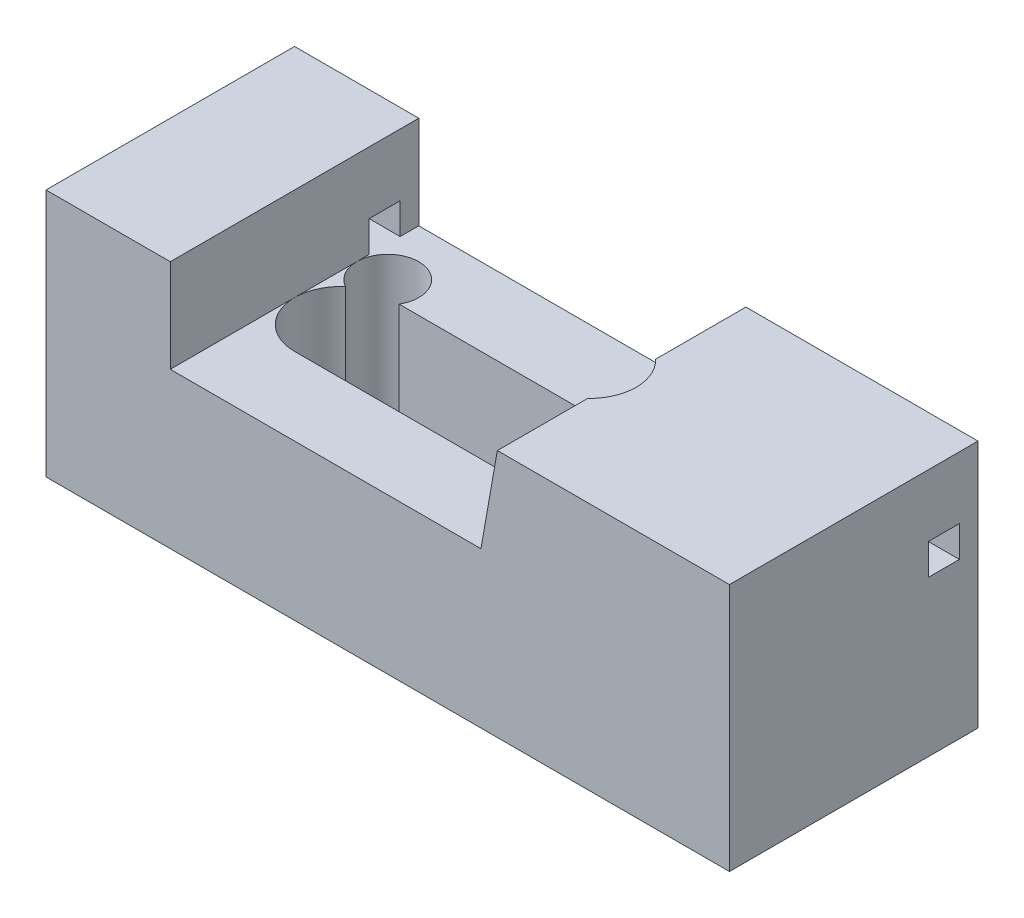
ISO-10303-21;
HEADER;
FILE_DESCRIPTION(('STEP AP214'),'2;1');
FILE_NAME('part.step','',(''),(''),'','','');
FILE_SCHEMA(('AUTOMOTIVE_DESIGN { 1 0 10303 214 1 1 1 1 }'));
ENDSEC;
DATA;
#1=APPLICATION_CONTEXT('core data for automotive mechanical design processes');
#2=APPLICATION_PROTOCOL_DEFINITION('international standard','automotive_design',2000,#1);
#3=PRODUCT_CONTEXT('',#1,'mechanical');
#4=PRODUCT('Part','Part','',(#3));
#5=PRODUCT_RELATED_PRODUCT_CATEGORY('part','',(#4));
#6=PRODUCT_DEFINITION_FORMATION('','',#4);
#7=PRODUCT_DEFINITION_CONTEXT('part definition',#1,'design');
#8=PRODUCT_DEFINITION('design','',#6,#7);
#9=PRODUCT_DEFINITION_SHAPE('','',#8);
#10=(LENGTH_UNIT() NAMED_UNIT(*) SI_UNIT(.MILLI.,.METRE.));
#11=(NAMED_UNIT(*) PLANE_ANGLE_UNIT() SI_UNIT($,.RADIAN.));
#12=(NAMED_UNIT(*) SI_UNIT($,.STERADIAN.) SOLID_ANGLE_UNIT());
#13=UNCERTAINTY_MEASURE_WITH_UNIT(LENGTH_MEASURE(1.E-05),#10,'distance_accuracy_value','');
#14=(GEOMETRIC_REPRESENTATION_CONTEXT(3) GLOBAL_UNCERTAINTY_ASSIGNED_CONTEXT((#13)) GLOBAL_UNIT_ASSIGNED_CONTEXT((#10,
#11,#12)) REPRESENTATION_CONTEXT('',''));
#15=CARTESIAN_POINT('',(0.,0.,0.));
#16=DIRECTION('',(0.,0.,1.));
#17=DIRECTION('',(1.,0.,0.));
#18=AXIS2_PLACEMENT_3D('',#15,#16,#17);
#19=CARTESIAN_POINT('',(70.,25.,40.));
#20=DIRECTION('',(0.,-1.,0.));
#21=DIRECTION('',(1.,0.,0.));
#22=AXIS2_PLACEMENT_3D('',#19,#20,#21);
#23=PLANE('',#22);
#24=CARTESIAN_POINT('',(27.5,25.,20.));
#25=DIRECTION('',(0.,-1.,0.));
#26=DIRECTION('',(1.,0.,0.));
#27=AXIS2_PLACEMENT_3D('',#24,#25,#26);
#28=CIRCLE('',#27,7.5);
#29=CARTESIAN_POINT('',(22.5547916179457,25.,14.3613020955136));
#30=VERTEX_POINT('',#29);
#31=CARTESIAN_POINT('',(20.,25.,20.));
#32=VERTEX_POINT('',#31);
#33=EDGE_CURVE('E282',#30,#32,#28,.F.);
#34=ORIENTED_EDGE('',*,*,#33,.F.);
#35=CARTESIAN_POINT('',(25.,25.,10.));
#36=DIRECTION('',(0.,-1.,0.));
#37=DIRECTION('',(1.,0.,0.));
#38=AXIS2_PLACEMENT_3D('',#35,#36,#37);
#39=CIRCLE('',#38,5.);
#40=CARTESIAN_POINT('',(20.,25.,10.));
#41=VERTEX_POINT('',#40);
#42=EDGE_CURVE('E253',#30,#41,#39,.T.);
#43=ORIENTED_EDGE('',*,*,#42,.T.);
#44=DIRECTION('',(0.,0.,-1.));
#45=VECTOR('',#44,1.);
#46=CARTESIAN_POINT('',(20.,25.,40.));
#47=LINE('',#46,#45);
#48=EDGE_CURVE('E331',#32,#41,#47,.T.);
#49=ORIENTED_EDGE('',*,*,#48,.F.);
#50=EDGE_LOOP('',(#34,#43,#49));
#51=FACE_BOUND('',#50,.T.);
#52=ADVANCED_FACE('F31',(#51),#23,.F.);
#53=CARTESIAN_POINT('',(0.,0.,40.));
#54=DIRECTION('',(0.,1.,0.));
#55=DIRECTION('',(0.,0.,1.));
#56=AXIS2_PLACEMENT_3D('',#53,#54,#55);
#57=PLANE('',#56);
#58=DIRECTION('',(1.,0.,0.));
#59=VECTOR('',#58,1.);
#60=CARTESIAN_POINT('',(0.,0.,0.));
#61=LINE('',#60,#59);
#62=CARTESIAN_POINT('',(0.,0.,0.));
#63=VERTEX_POINT('',#62);
#64=CARTESIAN_POINT('',(110.,0.,0.));
#65=VERTEX_POINT('',#64);
#66=EDGE_CURVE('E289',#63,#65,#61,.T.);
#67=ORIENTED_EDGE('',*,*,#66,.T.);
#68=DIRECTION('',(0.,0.,-1.));
#69=VECTOR('',#68,1.);
#70=CARTESIAN_POINT('',(110.,0.,40.));
#71=LINE('',#70,#69);
#72=CARTESIAN_POINT('',(110.,0.,40.));
#73=VERTEX_POINT('',#72);
#74=EDGE_CURVE('E340',#73,#65,#71,.T.);
#75=ORIENTED_EDGE('',*,*,#74,.F.);
#76=DIRECTION('',(1.,0.,0.));
#77=VECTOR('',#76,1.);
#78=CARTESIAN_POINT('',(0.,0.,40.));
#79=LINE('',#78,#77);
#80=CARTESIAN_POINT('',(0.,0.,40.));
#81=VERTEX_POINT('',#80);
#82=EDGE_CURVE('E308',#81,#73,#79,.T.);
#83=ORIENTED_EDGE('',*,*,#82,.F.);
#84=DIRECTION('',(0.,0.,-1.));
#85=VECTOR('',#84,1.);
#86=CARTESIAN_POINT('',(0.,0.,40.));
#87=LINE('',#86,#85);
#88=EDGE_CURVE('E344',#81,#63,#87,.T.);
#89=ORIENTED_EDGE('',*,*,#88,.T.);
#90=EDGE_LOOP('',(#67,#75,#83,#89));
#91=FACE_BOUND('',#90,.T.);
#92=DIRECTION('',(-1.,0.,0.));
#93=VECTOR('',#92,1.);
#94=CARTESIAN_POINT('',(67.5,0.,12.5));
#95=LINE('',#94,#93);
#96=CARTESIAN_POINT('',(67.5,0.,12.5));
#97=VERTEX_POINT('',#96);
#98=CARTESIAN_POINT('',(29.3301270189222,0.,12.5));
#99=VERTEX_POINT('',#98);
#100=EDGE_CURVE('E268',#97,#99,#95,.T.);
#101=ORIENTED_EDGE('',*,*,#100,.T.);
#102=CARTESIAN_POINT('',(25.,0.,10.));
#103=DIRECTION('',(0.,1.,0.));
#104=DIRECTION('',(0.,0.,1.));
#105=AXIS2_PLACEMENT_3D('',#102,#103,#104);
#106=CIRCLE('',#105,5.);
#107=CARTESIAN_POINT('',(22.5547916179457,0.,14.3613020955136));
#108=VERTEX_POINT('',#107);
#109=EDGE_CURVE('E250',#99,#108,#106,.T.);
#110=ORIENTED_EDGE('',*,*,#109,.T.);
#111=CARTESIAN_POINT('',(27.5,0.,20.));
#112=DIRECTION('',(0.,1.,0.));
#113=DIRECTION('',(0.,0.,1.));
#114=AXIS2_PLACEMENT_3D('',#111,#112,#113);
#115=CIRCLE('',#114,7.5);
#116=CARTESIAN_POINT('',(27.5,0.,27.5));
#117=VERTEX_POINT('',#116);
#118=EDGE_CURVE('E260',#108,#117,#115,.T.);
#119=ORIENTED_EDGE('',*,*,#118,.T.);
#120=DIRECTION('',(1.,0.,0.));
#121=VECTOR('',#120,1.);
#122=CARTESIAN_POINT('',(27.5,0.,27.5));
#123=LINE('',#122,#121);
#124=CARTESIAN_POINT('',(67.5,0.,27.5));
#125=VERTEX_POINT('',#124);
#126=EDGE_CURVE('E262',#117,#125,#123,.T.);
#127=ORIENTED_EDGE('',*,*,#126,.T.);
#128=CARTESIAN_POINT('',(67.5,0.,20.));
#129=DIRECTION('',(0.,1.,0.));
#130=DIRECTION('',(0.,0.,1.));
#131=AXIS2_PLACEMENT_3D('',#128,#129,#130);
#132=CIRCLE('',#131,7.5);
#133=EDGE_CURVE('E265',#125,#97,#132,.T.);
#134=ORIENTED_EDGE('',*,*,#133,.T.);
#135=EDGE_LOOP('',(#101,#110,#119,#127,#134));
#136=FACE_BOUND('',#135,.T.);
#137=ADVANCED_FACE('F383',(#91,#136),#57,.F.);
#138=CARTESIAN_POINT('',(110.,40.,40.));
#139=DIRECTION('',(0.,-1.,0.));
#140=DIRECTION('',(1.,0.,0.));
#141=AXIS2_PLACEMENT_3D('',#138,#139,#140);
#142=PLANE('',#141);
#143=CARTESIAN_POINT('',(67.5,40.,20.));
#144=DIRECTION('',(0.,1.,0.));
#145=DIRECTION('',(0.,0.,1.));
#146=AXIS2_PLACEMENT_3D('',#143,#144,#145);
#147=CIRCLE('',#146,7.5);
#148=CARTESIAN_POINT('',(72.644904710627,40.,25.4571013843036));
#149=VERTEX_POINT('',#148);
#150=CARTESIAN_POINT('',(72.644904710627,40.,14.5428986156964));
#151=VERTEX_POINT('',#150);
#152=EDGE_CURVE('E271',#149,#151,#147,.T.);
#153=ORIENTED_EDGE('',*,*,#152,.F.);
#154=DIRECTION('',(0.,0.,1.));
#155=VECTOR('',#154,1.);
#156=CARTESIAN_POINT('',(72.644904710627,40.,40.));
#157=LINE('',#156,#155);
#158=CARTESIAN_POINT('',(72.644904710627,40.,40.));
#159=VERTEX_POINT('',#158);
#160=EDGE_CURVE('E341',#159,#149,#157,.F.);
#161=ORIENTED_EDGE('',*,*,#160,.F.);
#162=DIRECTION('',(-1.,0.,0.));
#163=VECTOR('',#162,1.);
#164=CARTESIAN_POINT('',(110.,40.,40.));
#165=LINE('',#164,#163);
#166=CARTESIAN_POINT('',(110.,40.,40.));
#167=VERTEX_POINT('',#166);
#168=EDGE_CURVE('E312',#167,#159,#165,.T.);
#169=ORIENTED_EDGE('',*,*,#168,.F.);
#170=DIRECTION('',(0.,0.,-1.));
#171=VECTOR('',#170,1.);
#172=CARTESIAN_POINT('',(110.,40.,40.));
#173=LINE('',#172,#171);
#174=CARTESIAN_POINT('',(110.,40.,0.));
#175=VERTEX_POINT('',#174);
#176=EDGE_CURVE('E337',#167,#175,#173,.T.);
#177=ORIENTED_EDGE('',*,*,#176,.T.);
#178=DIRECTION('',(-1.,0.,0.));
#179=VECTOR('',#178,1.);
#180=CARTESIAN_POINT('',(110.,40.,0.));
#181=LINE('',#180,#179);
#182=CARTESIAN_POINT('',(72.644904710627,40.,0.));
#183=VERTEX_POINT('',#182);
#184=EDGE_CURVE('E293',#175,#183,#181,.T.);
#185=ORIENTED_EDGE('',*,*,#184,.T.);
#186=EDGE_CURVE('E335',#151,#183,#157,.F.);
#187=ORIENTED_EDGE('',*,*,#186,.F.);
#188=EDGE_LOOP('',(#153,#161,#169,#177,#185,#187));
#189=FACE_BOUND('',#188,.T.);
#190=ADVANCED_FACE('F391',(#189),#142,.F.);
#191=CARTESIAN_POINT('',(70.,25.,40.));
#192=DIRECTION('',(-0.984807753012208,0.173648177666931,0.));
#193=DIRECTION('',(-0.173648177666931,-0.984807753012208,0.));
#194=AXIS2_PLACEMENT_3D('',#191,#192,#193);
#195=PLANE('',#194);
#196=CARTESIAN_POINT('',(67.5,10.8217954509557,20.));
#197=DIRECTION('',(-0.984807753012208,0.173648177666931,0.));
#198=DIRECTION('',(-0.173648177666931,-0.984807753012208,0.));
#199=AXIS2_PLACEMENT_3D('',#196,#197,#198);
#200=ELLIPSE('',#199,43.1907786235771,7.5);
#201=CARTESIAN_POINT('',(70.,25.,27.0710678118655));
#202=VERTEX_POINT('',#201);
#203=EDGE_CURVE('E285',#202,#149,#200,.T.);
#204=ORIENTED_EDGE('',*,*,#203,.F.);
#205=DIRECTION('',(0.,0.,-1.));
#206=VECTOR('',#205,1.);
#207=CARTESIAN_POINT('',(70.,25.,40.));
#208=LINE('',#207,#206);
#209=CARTESIAN_POINT('',(70.,25.,40.));
#210=VERTEX_POINT('',#209);
#211=EDGE_CURVE('E332',#210,#202,#208,.T.);
#212=ORIENTED_EDGE('',*,*,#211,.F.);
#213=DIRECTION('',(0.173648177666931,0.984807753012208,0.));
#214=VECTOR('',#213,1.);
#215=CARTESIAN_POINT('',(70.,25.,40.));
#216=LINE('',#215,#214);
#217=EDGE_CURVE('E314',#159,#210,#216,.F.);
#218=ORIENTED_EDGE('',*,*,#217,.F.);
#219=ORIENTED_EDGE('',*,*,#160,.T.);
#220=EDGE_LOOP('',(#204,#212,#218,#219));
#221=FACE_BOUND('',#220,.T.);
#222=ADVANCED_FACE('F33',(#221),#195,.T.);
#223=CARTESIAN_POINT('',(70.,25.,3.));
#224=VERTEX_POINT('',#223);
#225=CARTESIAN_POINT('',(70.,25.,0.));
#226=VERTEX_POINT('',#225);
#227=EDGE_CURVE('E330',#224,#226,#208,.T.);
#228=ORIENTED_EDGE('',*,*,#227,.F.);
#229=DIRECTION('',(-0.173648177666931,-0.984807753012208,0.));
#230=VECTOR('',#229,1.);
#231=CARTESIAN_POINT('',(70.,25.,3.));
#232=LINE('',#231,#230);
#233=CARTESIAN_POINT('',(70.8816349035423,30.,3.));
#234=VERTEX_POINT('',#233);
#235=EDGE_CURVE('E247',#224,#234,#232,.F.);
#236=ORIENTED_EDGE('',*,*,#235,.T.);
#237=DIRECTION('',(0.,0.,-1.));
#238=VECTOR('',#237,1.);
#239=CARTESIAN_POINT('',(70.8816349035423,30.,40.));
#240=LINE('',#239,#238);
#241=CARTESIAN_POINT('',(70.8816349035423,30.,8.));
#242=VERTEX_POINT('',#241);
#243=EDGE_CURVE('E244',#234,#242,#240,.F.);
#244=ORIENTED_EDGE('',*,*,#243,.T.);
#245=DIRECTION('',(0.173648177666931,0.984807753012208,0.));
#246=VECTOR('',#245,1.);
#247=CARTESIAN_POINT('',(70.,25.,8.));
#248=LINE('',#247,#246);
#249=CARTESIAN_POINT('',(70.,25.,8.));
#250=VERTEX_POINT('',#249);
#251=EDGE_CURVE('E235',#242,#250,#248,.F.);
#252=ORIENTED_EDGE('',*,*,#251,.T.);
#253=CARTESIAN_POINT('',(70.,25.,12.9289321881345));
#254=VERTEX_POINT('',#253);
#255=EDGE_CURVE('E336',#254,#250,#208,.T.);
#256=ORIENTED_EDGE('',*,*,#255,.F.);
#257=EDGE_CURVE('E283',#151,#254,#200,.T.);
#258=ORIENTED_EDGE('',*,*,#257,.F.);
#259=ORIENTED_EDGE('',*,*,#186,.T.);
#260=DIRECTION('',(0.173648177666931,0.984807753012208,0.));
#261=VECTOR('',#260,1.);
#262=CARTESIAN_POINT('',(70.,25.,0.));
#263=LINE('',#262,#261);
#264=EDGE_CURVE('E296',#183,#226,#263,.F.);
#265=ORIENTED_EDGE('',*,*,#264,.T.);
#266=EDGE_LOOP('',(#228,#236,#244,#252,#256,#258,#259,#265));
#267=FACE_BOUND('',#266,.T.);
#268=ADVANCED_FACE('F399',(#267),#195,.T.);
#269=CARTESIAN_POINT('',(67.5,25.,20.));
#270=DIRECTION('',(0.,-1.,0.));
#271=DIRECTION('',(1.,0.,0.));
#272=AXIS2_PLACEMENT_3D('',#269,#270,#271);
#273=CIRCLE('',#272,7.5);
#274=CARTESIAN_POINT('',(67.5,25.,27.5));
#275=VERTEX_POINT('',#274);
#276=EDGE_CURVE('E359',#275,#202,#273,.F.);
#277=ORIENTED_EDGE('',*,*,#276,.F.);
#278=DIRECTION('',(1.,0.,0.));
#279=VECTOR('',#278,1.);
#280=CARTESIAN_POINT('',(70.,25.,27.5));
#281=LINE('',#280,#279);
#282=CARTESIAN_POINT('',(27.5,25.,27.5));
#283=VERTEX_POINT('',#282);
#284=EDGE_CURVE('E358',#283,#275,#281,.T.);
#285=ORIENTED_EDGE('',*,*,#284,.F.);
#286=EDGE_CURVE('E280',#32,#283,#28,.F.);
#287=ORIENTED_EDGE('',*,*,#286,.F.);
#288=CARTESIAN_POINT('',(20.,25.,40.));
#289=VERTEX_POINT('',#288);
#290=EDGE_CURVE('E327',#289,#32,#47,.T.);
#291=ORIENTED_EDGE('',*,*,#290,.F.);
#292=DIRECTION('',(-1.,0.,0.));
#293=VECTOR('',#292,1.);
#294=CARTESIAN_POINT('',(70.,25.,40.));
#295=LINE('',#294,#293);
#296=EDGE_CURVE('E315',#210,#289,#295,.T.);
#297=ORIENTED_EDGE('',*,*,#296,.F.);
#298=ORIENTED_EDGE('',*,*,#211,.T.);
#299=EDGE_LOOP('',(#277,#285,#287,#291,#297,#298));
#300=FACE_BOUND('',#299,.T.);
#301=ADVANCED_FACE('F386',(#300),#23,.F.);
#302=CARTESIAN_POINT('',(29.3301270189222,25.,12.5));
#303=VERTEX_POINT('',#302);
#304=EDGE_CURVE('E257',#41,#303,#39,.T.);
#305=ORIENTED_EDGE('',*,*,#304,.T.);
#306=DIRECTION('',(-1.,0.,0.));
#307=VECTOR('',#306,1.);
#308=CARTESIAN_POINT('',(70.,25.,12.5));
#309=LINE('',#308,#307);
#310=CARTESIAN_POINT('',(67.5,25.,12.5));
#311=VERTEX_POINT('',#310);
#312=EDGE_CURVE('E347',#311,#303,#309,.T.);
#313=ORIENTED_EDGE('',*,*,#312,.F.);
#314=EDGE_CURVE('E355',#254,#311,#273,.F.);
#315=ORIENTED_EDGE('',*,*,#314,.F.);
#316=ORIENTED_EDGE('',*,*,#255,.T.);
#317=DIRECTION('',(-1.,0.,0.));
#318=VECTOR('',#317,1.);
#319=CARTESIAN_POINT('',(110.,25.,8.));
#320=LINE('',#319,#318);
#321=CARTESIAN_POINT('',(110.,25.,8.));
#322=VERTEX_POINT('',#321);
#323=EDGE_CURVE('E203',#322,#250,#320,.T.);
#324=ORIENTED_EDGE('',*,*,#323,.F.);
#325=DIRECTION('',(0.,0.,1.));
#326=VECTOR('',#325,1.);
#327=CARTESIAN_POINT('',(110.,25.,3.));
#328=LINE('',#327,#326);
#329=CARTESIAN_POINT('',(110.,25.,3.));
#330=VERTEX_POINT('',#329);
#331=EDGE_CURVE('E223',#330,#322,#328,.T.);
#332=ORIENTED_EDGE('',*,*,#331,.F.);
#333=DIRECTION('',(-1.,0.,0.));
#334=VECTOR('',#333,1.);
#335=CARTESIAN_POINT('',(110.,25.,3.));
#336=LINE('',#335,#334);
#337=EDGE_CURVE('E46',#330,#224,#336,.T.);
#338=ORIENTED_EDGE('',*,*,#337,.T.);
#339=ORIENTED_EDGE('',*,*,#227,.T.);
#340=DIRECTION('',(-1.,0.,0.));
#341=VECTOR('',#340,1.);
#342=CARTESIAN_POINT('',(70.,25.,0.));
#343=LINE('',#342,#341);
#344=CARTESIAN_POINT('',(20.,25.,0.));
#345=VERTEX_POINT('',#344);
#346=EDGE_CURVE('E297',#226,#345,#343,.T.);
#347=ORIENTED_EDGE('',*,*,#346,.T.);
#348=CARTESIAN_POINT('',(20.,25.,3.));
#349=VERTEX_POINT('',#348);
#350=EDGE_CURVE('E326',#349,#345,#47,.T.);
#351=ORIENTED_EDGE('',*,*,#350,.F.);
#352=CARTESIAN_POINT('',(0.,25.,3.));
#353=VERTEX_POINT('',#352);
#354=EDGE_CURVE('E209',#349,#353,#336,.T.);
#355=ORIENTED_EDGE('',*,*,#354,.T.);
#356=DIRECTION('',(0.,0.,1.));
#357=VECTOR('',#356,1.);
#358=CARTESIAN_POINT('',(0.,25.,3.));
#359=LINE('',#358,#357);
#360=CARTESIAN_POINT('',(0.,25.,8.));
#361=VERTEX_POINT('',#360);
#362=EDGE_CURVE('E206',#353,#361,#359,.T.);
#363=ORIENTED_EDGE('',*,*,#362,.T.);
#364=CARTESIAN_POINT('',(20.,25.,8.));
#365=VERTEX_POINT('',#364);
#366=EDGE_CURVE('E192',#365,#361,#320,.T.);
#367=ORIENTED_EDGE('',*,*,#366,.F.);
#368=EDGE_CURVE('E441',#41,#365,#47,.T.);
#369=ORIENTED_EDGE('',*,*,#368,.F.);
#370=EDGE_LOOP('',(#305,#313,#315,#316,#324,#332,#338,#339,#347,#351,#355,#363,#367,#369));
#371=FACE_BOUND('',#370,.T.);
#372=ADVANCED_FACE('F207',(#371),#23,.F.);
#373=CARTESIAN_POINT('',(0.,40.,40.));
#374=DIRECTION('',(1.,0.,0.));
#375=DIRECTION('',(0.,1.,0.));
#376=AXIS2_PLACEMENT_3D('',#373,#374,#375);
#377=PLANE('',#376);
#378=ORIENTED_EDGE('',*,*,#362,.F.);
#379=DIRECTION('',(0.,-1.,0.));
#380=VECTOR('',#379,1.);
#381=CARTESIAN_POINT('',(0.,30.,3.));
#382=LINE('',#381,#380);
#383=CARTESIAN_POINT('',(0.,30.,3.));
#384=VERTEX_POINT('',#383);
#385=EDGE_CURVE('E54',#384,#353,#382,.T.);
#386=ORIENTED_EDGE('',*,*,#385,.F.);
#387=DIRECTION('',(0.,0.,-1.));
#388=VECTOR('',#387,1.);
#389=CARTESIAN_POINT('',(0.,30.,3.));
#390=LINE('',#389,#388);
#391=CARTESIAN_POINT('',(0.,30.,8.));
#392=VERTEX_POINT('',#391);
#393=EDGE_CURVE('E215',#392,#384,#390,.T.);
#394=ORIENTED_EDGE('',*,*,#393,.F.);
#395=DIRECTION('',(0.,1.,0.));
#396=VECTOR('',#395,1.);
#397=CARTESIAN_POINT('',(0.,30.,8.));
#398=LINE('',#397,#396);
#399=EDGE_CURVE('E197',#361,#392,#398,.T.);
#400=ORIENTED_EDGE('',*,*,#399,.F.);
#401=EDGE_LOOP('',(#378,#386,#394,#400));
#402=FACE_BOUND('',#401,.T.);
#403=DIRECTION('',(0.,-1.,0.));
#404=VECTOR('',#403,1.);
#405=CARTESIAN_POINT('',(0.,40.,0.));
#406=LINE('',#405,#404);
#407=CARTESIAN_POINT('',(0.,40.,0.));
#408=VERTEX_POINT('',#407);
#409=EDGE_CURVE('E286',#408,#63,#406,.T.);
#410=ORIENTED_EDGE('',*,*,#409,.T.);
#411=ORIENTED_EDGE('',*,*,#88,.F.);
#412=DIRECTION('',(0.,-1.,0.));
#413=VECTOR('',#412,1.);
#414=CARTESIAN_POINT('',(0.,40.,40.));
#415=LINE('',#414,#413);
#416=CARTESIAN_POINT('',(0.,40.,40.));
#417=VERTEX_POINT('',#416);
#418=EDGE_CURVE('E305',#417,#81,#415,.T.);
#419=ORIENTED_EDGE('',*,*,#418,.F.);
#420=DIRECTION('',(0.,0.,-1.));
#421=VECTOR('',#420,1.);
#422=CARTESIAN_POINT('',(0.,40.,40.));
#423=LINE('',#422,#421);
#424=EDGE_CURVE('E321',#417,#408,#423,.T.);
#425=ORIENTED_EDGE('',*,*,#424,.T.);
#426=EDGE_LOOP('',(#410,#411,#419,#425));
#427=FACE_BOUND('',#426,.T.);
#428=ADVANCED_FACE('F212',(#402,#427),#377,.F.);
#429=CARTESIAN_POINT('',(110.,0.,40.));
#430=DIRECTION('',(-1.,0.,0.));
#431=DIRECTION('',(0.,0.,1.));
#432=AXIS2_PLACEMENT_3D('',#429,#430,#431);
#433=PLANE('',#432);
#434=DIRECTION('',(0.,0.,-1.));
#435=VECTOR('',#434,1.);
#436=CARTESIAN_POINT('',(110.,30.,3.));
#437=LINE('',#436,#435);
#438=CARTESIAN_POINT('',(110.,30.,8.));
#439=VERTEX_POINT('',#438);
#440=CARTESIAN_POINT('',(110.,30.,3.));
#441=VERTEX_POINT('',#440);
#442=EDGE_CURVE('E229',#439,#441,#437,.T.);
#443=ORIENTED_EDGE('',*,*,#442,.T.);
#444=DIRECTION('',(0.,-1.,0.));
#445=VECTOR('',#444,1.);
#446=CARTESIAN_POINT('',(110.,30.,3.));
#447=LINE('',#446,#445);
#448=EDGE_CURVE('E217',#441,#330,#447,.T.);
#449=ORIENTED_EDGE('',*,*,#448,.T.);
#450=ORIENTED_EDGE('',*,*,#331,.T.);
#451=DIRECTION('',(0.,1.,0.));
#452=VECTOR('',#451,1.);
#453=CARTESIAN_POINT('',(110.,30.,8.));
#454=LINE('',#453,#452);
#455=EDGE_CURVE('E226',#322,#439,#454,.T.);
#456=ORIENTED_EDGE('',*,*,#455,.T.);
#457=EDGE_LOOP('',(#443,#449,#450,#456));
#458=FACE_BOUND('',#457,.T.);
#459=DIRECTION('',(0.,1.,0.));
#460=VECTOR('',#459,1.);
#461=CARTESIAN_POINT('',(110.,0.,0.));
#462=LINE('',#461,#460);
#463=EDGE_CURVE('E291',#65,#175,#462,.T.);
#464=ORIENTED_EDGE('',*,*,#463,.T.);
#465=ORIENTED_EDGE('',*,*,#176,.F.);
#466=DIRECTION('',(0.,1.,0.));
#467=VECTOR('',#466,1.);
#468=CARTESIAN_POINT('',(110.,0.,40.));
#469=LINE('',#468,#467);
#470=EDGE_CURVE('E310',#73,#167,#469,.T.);
#471=ORIENTED_EDGE('',*,*,#470,.F.);
#472=ORIENTED_EDGE('',*,*,#74,.T.);
#473=EDGE_LOOP('',(#464,#465,#471,#472));
#474=FACE_BOUND('',#473,.T.);
#475=ADVANCED_FACE('F468',(#458,#474),#433,.F.);
#476=CARTESIAN_POINT('',(20.,25.,40.));
#477=DIRECTION('',(-1.,0.,0.));
#478=DIRECTION('',(0.,0.,1.));
#479=AXIS2_PLACEMENT_3D('',#476,#477,#478);
#480=PLANE('',#479);
#481=DIRECTION('',(0.,0.,-1.));
#482=VECTOR('',#481,1.);
#483=CARTESIAN_POINT('',(20.,30.,40.));
#484=LINE('',#483,#482);
#485=CARTESIAN_POINT('',(20.,30.,8.));
#486=VERTEX_POINT('',#485);
#487=CARTESIAN_POINT('',(20.,30.,3.));
#488=VERTEX_POINT('',#487);
#489=EDGE_CURVE('E39',#486,#488,#484,.T.);
#490=ORIENTED_EDGE('',*,*,#489,.T.);
#491=DIRECTION('',(0.,-1.,0.));
#492=VECTOR('',#491,1.);
#493=CARTESIAN_POINT('',(20.,25.,3.));
#494=LINE('',#493,#492);
#495=EDGE_CURVE('E11',#488,#349,#494,.T.);
#496=ORIENTED_EDGE('',*,*,#495,.T.);
#497=ORIENTED_EDGE('',*,*,#350,.T.);
#498=DIRECTION('',(0.,1.,0.));
#499=VECTOR('',#498,1.);
#500=CARTESIAN_POINT('',(20.,25.,0.));
#501=LINE('',#500,#499);
#502=CARTESIAN_POINT('',(20.,40.,0.));
#503=VERTEX_POINT('',#502);
#504=EDGE_CURVE('E300',#345,#503,#501,.T.);
#505=ORIENTED_EDGE('',*,*,#504,.T.);
#506=DIRECTION('',(0.,0.,-1.));
#507=VECTOR('',#506,1.);
#508=CARTESIAN_POINT('',(20.,40.,40.));
#509=LINE('',#508,#507);
#510=CARTESIAN_POINT('',(20.,40.,40.));
#511=VERTEX_POINT('',#510);
#512=EDGE_CURVE('E324',#511,#503,#509,.T.);
#513=ORIENTED_EDGE('',*,*,#512,.F.);
#514=DIRECTION('',(0.,1.,0.));
#515=VECTOR('',#514,1.);
#516=CARTESIAN_POINT('',(20.,25.,40.));
#517=LINE('',#516,#515);
#518=EDGE_CURVE('E317',#289,#511,#517,.T.);
#519=ORIENTED_EDGE('',*,*,#518,.F.);
#520=ORIENTED_EDGE('',*,*,#290,.T.);
#521=ORIENTED_EDGE('',*,*,#48,.T.);
#522=ORIENTED_EDGE('',*,*,#368,.T.);
#523=DIRECTION('',(0.,1.,0.));
#524=VECTOR('',#523,1.);
#525=CARTESIAN_POINT('',(20.,25.,8.));
#526=LINE('',#525,#524);
#527=EDGE_CURVE('E200',#365,#486,#526,.T.);
#528=ORIENTED_EDGE('',*,*,#527,.T.);
#529=EDGE_LOOP('',(#490,#496,#497,#505,#513,#519,#520,#521,#522,#528));
#530=FACE_BOUND('',#529,.T.);
#531=ADVANCED_FACE('F365',(#530),#480,.F.);
#532=CARTESIAN_POINT('',(20.,40.,40.));
#533=DIRECTION('',(0.,-1.,0.));
#534=DIRECTION('',(0.,0.,-1.));
#535=AXIS2_PLACEMENT_3D('',#532,#533,#534);
#536=PLANE('',#535);
#537=DIRECTION('',(-1.,0.,0.));
#538=VECTOR('',#537,1.);
#539=CARTESIAN_POINT('',(20.,40.,0.));
#540=LINE('',#539,#538);
#541=EDGE_CURVE('E303',#503,#408,#540,.T.);
#542=ORIENTED_EDGE('',*,*,#541,.T.);
#543=ORIENTED_EDGE('',*,*,#424,.F.);
#544=DIRECTION('',(-1.,0.,0.));
#545=VECTOR('',#544,1.);
#546=CARTESIAN_POINT('',(20.,40.,40.));
#547=LINE('',#546,#545);
#548=EDGE_CURVE('E319',#511,#417,#547,.T.);
#549=ORIENTED_EDGE('',*,*,#548,.F.);
#550=ORIENTED_EDGE('',*,*,#512,.T.);
#551=EDGE_LOOP('',(#542,#543,#549,#550));
#552=FACE_BOUND('',#551,.T.);
#553=ADVANCED_FACE('F473',(#552),#536,.F.);
#554=CARTESIAN_POINT('',(0.,0.,40.));
#555=DIRECTION('',(0.,0.,1.));
#556=DIRECTION('',(1.,0.,0.));
#557=AXIS2_PLACEMENT_3D('',#554,#555,#556);
#558=PLANE('',#557);
#559=ORIENTED_EDGE('',*,*,#418,.T.);
#560=ORIENTED_EDGE('',*,*,#82,.T.);
#561=ORIENTED_EDGE('',*,*,#470,.T.);
#562=ORIENTED_EDGE('',*,*,#168,.T.);
#563=ORIENTED_EDGE('',*,*,#217,.T.);
#564=ORIENTED_EDGE('',*,*,#296,.T.);
#565=ORIENTED_EDGE('',*,*,#518,.T.);
#566=ORIENTED_EDGE('',*,*,#548,.T.);
#567=EDGE_LOOP('',(#559,#560,#561,#562,#563,#564,#565,#566));
#568=FACE_BOUND('',#567,.T.);
#569=ADVANCED_FACE('F462',(#568),#558,.T.);
#570=CARTESIAN_POINT('',(0.,0.,0.));
#571=DIRECTION('',(0.,0.,1.));
#572=DIRECTION('',(1.,0.,0.));
#573=AXIS2_PLACEMENT_3D('',#570,#571,#572);
#574=PLANE('',#573);
#575=ORIENTED_EDGE('',*,*,#409,.F.);
#576=ORIENTED_EDGE('',*,*,#541,.F.);
#577=ORIENTED_EDGE('',*,*,#504,.F.);
#578=ORIENTED_EDGE('',*,*,#346,.F.);
#579=ORIENTED_EDGE('',*,*,#264,.F.);
#580=ORIENTED_EDGE('',*,*,#184,.F.);
#581=ORIENTED_EDGE('',*,*,#463,.F.);
#582=ORIENTED_EDGE('',*,*,#66,.F.);
#583=EDGE_LOOP('',(#575,#576,#577,#578,#579,#580,#581,#582));
#584=FACE_BOUND('',#583,.T.);
#585=ADVANCED_FACE('F436',(#584),#574,.F.);
#586=CARTESIAN_POINT('',(27.5,40.,27.5));
#587=DIRECTION('',(0.,0.,-1.));
#588=DIRECTION('',(-1.,0.,0.));
#589=AXIS2_PLACEMENT_3D('',#586,#587,#588);
#590=PLANE('',#589);
#591=ORIENTED_EDGE('',*,*,#284,.T.);
#592=DIRECTION('',(0.,-1.,0.));
#593=VECTOR('',#592,1.);
#594=CARTESIAN_POINT('',(67.5,40.,27.5));
#595=LINE('',#594,#593);
#596=EDGE_CURVE('E275',#275,#125,#595,.T.);
#597=ORIENTED_EDGE('',*,*,#596,.T.);
#598=ORIENTED_EDGE('',*,*,#126,.F.);
#599=DIRECTION('',(0.,-1.,0.));
#600=VECTOR('',#599,1.);
#601=CARTESIAN_POINT('',(27.5,40.,27.5));
#602=LINE('',#601,#600);
#603=EDGE_CURVE('E277',#283,#117,#602,.T.);
#604=ORIENTED_EDGE('',*,*,#603,.F.);
#605=EDGE_LOOP('',(#591,#597,#598,#604));
#606=FACE_BOUND('',#605,.T.);
#607=ADVANCED_FACE('F458',(#606),#590,.T.);
#608=CARTESIAN_POINT('',(67.5,40.,20.));
#609=DIRECTION('',(0.,-1.,0.));
#610=DIRECTION('',(0.,0.,-1.));
#611=AXIS2_PLACEMENT_3D('',#608,#609,#610);
#612=CYLINDRICAL_SURFACE('',#611,7.5);
#613=ORIENTED_EDGE('',*,*,#203,.T.);
#614=ORIENTED_EDGE('',*,*,#152,.T.);
#615=ORIENTED_EDGE('',*,*,#257,.T.);
#616=ORIENTED_EDGE('',*,*,#314,.T.);
#617=DIRECTION('',(0.,-1.,0.));
#618=VECTOR('',#617,1.);
#619=CARTESIAN_POINT('',(67.5,40.,12.5));
#620=LINE('',#619,#618);
#621=EDGE_CURVE('E273',#311,#97,#620,.T.);
#622=ORIENTED_EDGE('',*,*,#621,.T.);
#623=ORIENTED_EDGE('',*,*,#133,.F.);
#624=ORIENTED_EDGE('',*,*,#596,.F.);
#625=ORIENTED_EDGE('',*,*,#276,.T.);
#626=EDGE_LOOP('',(#613,#614,#615,#616,#622,#623,#624,#625));
#627=FACE_BOUND('',#626,.T.);
#628=ADVANCED_FACE('F415',(#627),#612,.F.);
#629=CARTESIAN_POINT('',(67.5,40.,12.5));
#630=DIRECTION('',(0.,0.,1.));
#631=DIRECTION('',(1.,0.,0.));
#632=AXIS2_PLACEMENT_3D('',#629,#630,#631);
#633=PLANE('',#632);
#634=DIRECTION('',(0.,1.,0.));
#635=VECTOR('',#634,1.);
#636=CARTESIAN_POINT('',(29.3301270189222,0.,12.5));
#637=LINE('',#636,#635);
#638=EDGE_CURVE('E256',#99,#303,#637,.T.);
#639=ORIENTED_EDGE('',*,*,#638,.F.);
#640=ORIENTED_EDGE('',*,*,#100,.F.);
#641=ORIENTED_EDGE('',*,*,#621,.F.);
#642=ORIENTED_EDGE('',*,*,#312,.T.);
#643=EDGE_LOOP('',(#639,#640,#641,#642));
#644=FACE_BOUND('',#643,.T.);
#645=ADVANCED_FACE('F452',(#644),#633,.T.);
#646=CARTESIAN_POINT('',(27.5,40.,20.));
#647=DIRECTION('',(0.,-1.,0.));
#648=DIRECTION('',(0.,0.,-1.));
#649=AXIS2_PLACEMENT_3D('',#646,#647,#648);
#650=CYLINDRICAL_SURFACE('',#649,7.5);
#651=DIRECTION('',(0.,1.,0.));
#652=VECTOR('',#651,1.);
#653=CARTESIAN_POINT('',(22.5547916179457,20.,14.3613020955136));
#654=LINE('',#653,#652);
#655=EDGE_CURVE('E361',#30,#108,#654,.F.);
#656=ORIENTED_EDGE('',*,*,#655,.F.);
#657=ORIENTED_EDGE('',*,*,#33,.T.);
#658=ORIENTED_EDGE('',*,*,#286,.T.);
#659=ORIENTED_EDGE('',*,*,#603,.T.);
#660=ORIENTED_EDGE('',*,*,#118,.F.);
#661=EDGE_LOOP('',(#656,#657,#658,#659,#660));
#662=FACE_BOUND('',#661,.T.);
#663=ADVANCED_FACE('F460',(#662),#650,.F.);
#664=CARTESIAN_POINT('',(25.,0.,10.));
#665=DIRECTION('',(0.,1.,0.));
#666=DIRECTION('',(0.,0.,1.));
#667=AXIS2_PLACEMENT_3D('',#664,#665,#666);
#668=CYLINDRICAL_SURFACE('',#667,5.);
#669=ORIENTED_EDGE('',*,*,#42,.F.);
#670=ORIENTED_EDGE('',*,*,#655,.T.);
#671=ORIENTED_EDGE('',*,*,#109,.F.);
#672=ORIENTED_EDGE('',*,*,#638,.T.);
#673=ORIENTED_EDGE('',*,*,#304,.F.);
#674=EDGE_LOOP('',(#669,#670,#671,#672,#673));
#675=FACE_BOUND('',#674,.T.);
#676=ADVANCED_FACE('F449',(#675),#668,.F.);
#677=CARTESIAN_POINT('',(110.,30.,8.));
#678=DIRECTION('',(0.,0.,1.));
#679=DIRECTION('',(0.,-1.,0.));
#680=AXIS2_PLACEMENT_3D('',#677,#678,#679);
#681=PLANE('',#680);
#682=ORIENTED_EDGE('',*,*,#366,.T.);
#683=ORIENTED_EDGE('',*,*,#399,.T.);
#684=DIRECTION('',(-1.,0.,0.));
#685=VECTOR('',#684,1.);
#686=CARTESIAN_POINT('',(110.,30.,8.));
#687=LINE('',#686,#685);
#688=EDGE_CURVE('E239',#486,#392,#687,.T.);
#689=ORIENTED_EDGE('',*,*,#688,.F.);
#690=ORIENTED_EDGE('',*,*,#527,.F.);
#691=EDGE_LOOP('',(#682,#683,#689,#690));
#692=FACE_BOUND('',#691,.T.);
#693=ADVANCED_FACE('F194',(#692),#681,.F.);
#694=CARTESIAN_POINT('',(110.,30.,3.));
#695=DIRECTION('',(0.,1.,0.));
#696=DIRECTION('',(-1.,0.,0.));
#697=AXIS2_PLACEMENT_3D('',#694,#695,#696);
#698=PLANE('',#697);
#699=ORIENTED_EDGE('',*,*,#688,.T.);
#700=ORIENTED_EDGE('',*,*,#393,.T.);
#701=DIRECTION('',(-1.,0.,0.));
#702=VECTOR('',#701,1.);
#703=CARTESIAN_POINT('',(110.,30.,3.));
#704=LINE('',#703,#702);
#705=EDGE_CURVE('E236',#488,#384,#704,.T.);
#706=ORIENTED_EDGE('',*,*,#705,.F.);
#707=ORIENTED_EDGE('',*,*,#489,.F.);
#708=EDGE_LOOP('',(#699,#700,#706,#707));
#709=FACE_BOUND('',#708,.T.);
#710=ADVANCED_FACE('F368',(#709),#698,.F.);
#711=CARTESIAN_POINT('',(110.,30.,3.));
#712=DIRECTION('',(0.,0.,-1.));
#713=DIRECTION('',(0.,1.,0.));
#714=AXIS2_PLACEMENT_3D('',#711,#712,#713);
#715=PLANE('',#714);
#716=ORIENTED_EDGE('',*,*,#705,.T.);
#717=ORIENTED_EDGE('',*,*,#385,.T.);
#718=ORIENTED_EDGE('',*,*,#354,.F.);
#719=ORIENTED_EDGE('',*,*,#495,.F.);
#720=EDGE_LOOP('',(#716,#717,#718,#719));
#721=FACE_BOUND('',#720,.T.);
#722=ADVANCED_FACE('F369',(#721),#715,.F.);
#723=ORIENTED_EDGE('',*,*,#337,.F.);
#724=ORIENTED_EDGE('',*,*,#448,.F.);
#725=EDGE_CURVE('E232',#441,#234,#704,.T.);
#726=ORIENTED_EDGE('',*,*,#725,.T.);
#727=ORIENTED_EDGE('',*,*,#235,.F.);
#728=EDGE_LOOP('',(#723,#724,#726,#727));
#729=FACE_BOUND('',#728,.T.);
#730=ADVANCED_FACE('F371',(#729),#715,.F.);
#731=ORIENTED_EDGE('',*,*,#725,.F.);
#732=ORIENTED_EDGE('',*,*,#442,.F.);
#733=EDGE_CURVE('E237',#439,#242,#687,.T.);
#734=ORIENTED_EDGE('',*,*,#733,.T.);
#735=ORIENTED_EDGE('',*,*,#243,.F.);
#736=EDGE_LOOP('',(#731,#732,#734,#735));
#737=FACE_BOUND('',#736,.T.);
#738=ADVANCED_FACE('F377',(#737),#698,.F.);
#739=ORIENTED_EDGE('',*,*,#733,.F.);
#740=ORIENTED_EDGE('',*,*,#455,.F.);
#741=ORIENTED_EDGE('',*,*,#323,.T.);
#742=ORIENTED_EDGE('',*,*,#251,.F.);
#743=EDGE_LOOP('',(#739,#740,#741,#742));
#744=FACE_BOUND('',#743,.T.);
#745=ADVANCED_FACE('F493',(#744),#681,.F.);
#746=CLOSED_SHELL('',(#52,#137,#190,#222,#268,#301,#372,#428,#475,#531,#553,#569,#585,#607,#628,
#645,#663,#676,#693,#710,#722,#730,#738,#745));
#747=MANIFOLD_SOLID_BREP('B2',#746);
#748=ADVANCED_BREP_SHAPE_REPRESENTATION('',(#18,#747),#14);
#749=SHAPE_DEFINITION_REPRESENTATION(#9,#748);
ENDSEC;
END-ISO-10303-21;
